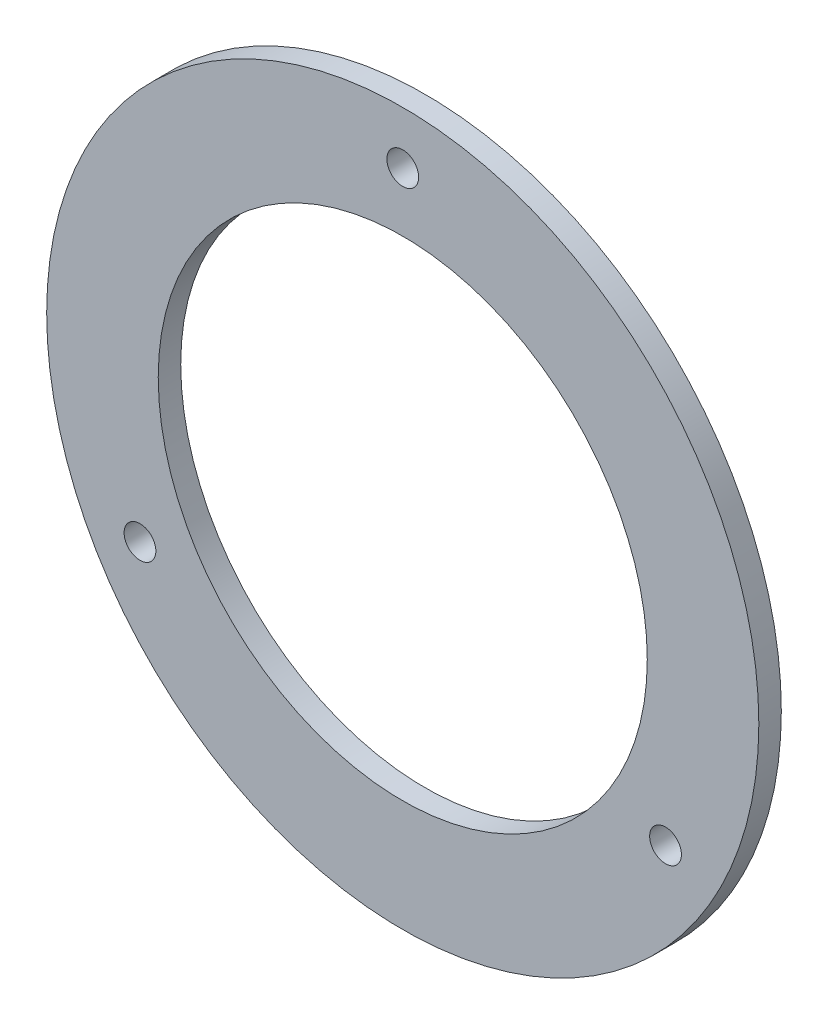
ISO-10303-21;
HEADER;
FILE_DESCRIPTION(('STEP AP214'),'2;1');
FILE_NAME('part.step','',(''),(''),'','','');
FILE_SCHEMA(('AUTOMOTIVE_DESIGN { 1 0 10303 214 1 1 1 1 }'));
ENDSEC;
DATA;
#1=APPLICATION_CONTEXT('core data for automotive mechanical design processes');
#2=APPLICATION_PROTOCOL_DEFINITION('international standard','automotive_design',2000,#1);
#3=PRODUCT_CONTEXT('',#1,'mechanical');
#4=PRODUCT('Part','Part','',(#3));
#5=PRODUCT_RELATED_PRODUCT_CATEGORY('part','',(#4));
#6=PRODUCT_DEFINITION_FORMATION('','',#4);
#7=PRODUCT_DEFINITION_CONTEXT('part definition',#1,'design');
#8=PRODUCT_DEFINITION('design','',#6,#7);
#9=PRODUCT_DEFINITION_SHAPE('','',#8);
#10=(LENGTH_UNIT() NAMED_UNIT(*) SI_UNIT(.MILLI.,.METRE.));
#11=(NAMED_UNIT(*) PLANE_ANGLE_UNIT() SI_UNIT($,.RADIAN.));
#12=(NAMED_UNIT(*) SI_UNIT($,.STERADIAN.) SOLID_ANGLE_UNIT());
#13=UNCERTAINTY_MEASURE_WITH_UNIT(LENGTH_MEASURE(1.E-05),#10,'distance_accuracy_value','');
#14=(GEOMETRIC_REPRESENTATION_CONTEXT(3) GLOBAL_UNCERTAINTY_ASSIGNED_CONTEXT((#13)) GLOBAL_UNIT_ASSIGNED_CONTEXT((#10,
#11,#12)) REPRESENTATION_CONTEXT('',''));
#15=CARTESIAN_POINT('',(0.,0.,0.));
#16=DIRECTION('',(0.,0.,1.));
#17=DIRECTION('',(1.,0.,0.));
#18=AXIS2_PLACEMENT_3D('',#15,#16,#17);
#19=CARTESIAN_POINT('',(0.,0.,1.6002));
#20=DIRECTION('',(0.,0.,1.));
#21=DIRECTION('',(1.,0.,0.));
#22=AXIS2_PLACEMENT_3D('',#19,#20,#21);
#23=PLANE('',#22);
#24=CARTESIAN_POINT('',(0.,21.59,1.6002));
#25=DIRECTION('',(0.,0.,1.));
#26=DIRECTION('',(1.,0.,0.));
#27=AXIS2_PLACEMENT_3D('',#24,#25,#26);
#28=CIRCLE('',#27,1.13029999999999);
#29=CARTESIAN_POINT('',(1.13029999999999,21.59,1.6002));
#30=VERTEX_POINT('',#29);
#31=EDGE_CURVE('E66',#30,#30,#28,.T.);
#32=ORIENTED_EDGE('',*,*,#31,.F.);
#33=EDGE_LOOP('',(#32));
#34=FACE_BOUND('',#33,.T.);
#35=CARTESIAN_POINT('',(18.6974884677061,-10.7949999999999,1.6002));
#36=DIRECTION('',(0.,0.,1.));
#37=DIRECTION('',(1.,0.,0.));
#38=AXIS2_PLACEMENT_3D('',#35,#36,#37);
#39=CIRCLE('',#38,1.13029999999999);
#40=CARTESIAN_POINT('',(19.827788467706,-10.7949999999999,1.6002));
#41=VERTEX_POINT('',#40);
#42=EDGE_CURVE('E60',#41,#41,#39,.T.);
#43=ORIENTED_EDGE('',*,*,#42,.F.);
#44=EDGE_LOOP('',(#43));
#45=FACE_BOUND('',#44,.T.);
#46=CARTESIAN_POINT('',(-18.6974884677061,-10.795,1.6002));
#47=DIRECTION('',(0.,0.,1.));
#48=DIRECTION('',(1.,0.,0.));
#49=AXIS2_PLACEMENT_3D('',#46,#47,#48);
#50=CIRCLE('',#49,1.13029999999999);
#51=CARTESIAN_POINT('',(-17.5671884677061,-10.795,1.6002));
#52=VERTEX_POINT('',#51);
#53=EDGE_CURVE('E54',#52,#52,#50,.T.);
#54=ORIENTED_EDGE('',*,*,#53,.F.);
#55=EDGE_LOOP('',(#54));
#56=FACE_BOUND('',#55,.T.);
#57=CARTESIAN_POINT('',(0.,0.,1.6002));
#58=DIRECTION('',(0.,0.,1.));
#59=DIRECTION('',(1.,0.,0.));
#60=AXIS2_PLACEMENT_3D('',#57,#58,#59);
#61=CIRCLE('',#60,25.3365);
#62=CARTESIAN_POINT('',(25.3365,0.,1.6002));
#63=VERTEX_POINT('',#62);
#64=EDGE_CURVE('E10',#63,#63,#61,.T.);
#65=ORIENTED_EDGE('',*,*,#64,.T.);
#66=EDGE_LOOP('',(#65));
#67=FACE_BOUND('',#66,.T.);
#68=CARTESIAN_POINT('',(0.,0.,1.6002));
#69=DIRECTION('',(0.,0.,1.));
#70=DIRECTION('',(1.,0.,0.));
#71=AXIS2_PLACEMENT_3D('',#68,#69,#70);
#72=CIRCLE('',#71,17.399);
#73=CARTESIAN_POINT('',(17.399,0.,1.6002));
#74=VERTEX_POINT('',#73);
#75=EDGE_CURVE('E44',#74,#74,#72,.T.);
#76=ORIENTED_EDGE('',*,*,#75,.F.);
#77=EDGE_LOOP('',(#76));
#78=FACE_BOUND('',#77,.T.);
#79=ADVANCED_FACE('F33',(#34,#45,#56,#67,#78),#23,.T.);
#80=CARTESIAN_POINT('',(0.,0.,0.));
#81=DIRECTION('',(0.,0.,1.));
#82=DIRECTION('',(1.,0.,0.));
#83=AXIS2_PLACEMENT_3D('',#80,#81,#82);
#84=PLANE('',#83);
#85=CARTESIAN_POINT('',(0.,21.59,0.));
#86=DIRECTION('',(0.,0.,1.));
#87=DIRECTION('',(1.,0.,0.));
#88=AXIS2_PLACEMENT_3D('',#85,#86,#87);
#89=CIRCLE('',#88,1.13029999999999);
#90=CARTESIAN_POINT('',(1.13029999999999,21.59,0.));
#91=VERTEX_POINT('',#90);
#92=EDGE_CURVE('E63',#91,#91,#89,.T.);
#93=ORIENTED_EDGE('',*,*,#92,.T.);
#94=EDGE_LOOP('',(#93));
#95=FACE_BOUND('',#94,.T.);
#96=CARTESIAN_POINT('',(18.6974884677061,-10.7949999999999,0.));
#97=DIRECTION('',(0.,0.,1.));
#98=DIRECTION('',(1.,0.,0.));
#99=AXIS2_PLACEMENT_3D('',#96,#97,#98);
#100=CIRCLE('',#99,1.13029999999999);
#101=CARTESIAN_POINT('',(19.827788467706,-10.7949999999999,0.));
#102=VERTEX_POINT('',#101);
#103=EDGE_CURVE('E57',#102,#102,#100,.T.);
#104=ORIENTED_EDGE('',*,*,#103,.T.);
#105=EDGE_LOOP('',(#104));
#106=FACE_BOUND('',#105,.T.);
#107=CARTESIAN_POINT('',(-18.6974884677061,-10.795,0.));
#108=DIRECTION('',(0.,0.,1.));
#109=DIRECTION('',(1.,0.,0.));
#110=AXIS2_PLACEMENT_3D('',#107,#108,#109);
#111=CIRCLE('',#110,1.13029999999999);
#112=CARTESIAN_POINT('',(-17.5671884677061,-10.795,0.));
#113=VERTEX_POINT('',#112);
#114=EDGE_CURVE('E49',#113,#113,#111,.T.);
#115=ORIENTED_EDGE('',*,*,#114,.T.);
#116=EDGE_LOOP('',(#115));
#117=FACE_BOUND('',#116,.T.);
#118=CARTESIAN_POINT('',(0.,0.,0.));
#119=DIRECTION('',(0.,0.,1.));
#120=DIRECTION('',(1.,0.,0.));
#121=AXIS2_PLACEMENT_3D('',#118,#119,#120);
#122=CIRCLE('',#121,25.3365);
#123=CARTESIAN_POINT('',(25.3365,0.,0.));
#124=VERTEX_POINT('',#123);
#125=EDGE_CURVE('E37',#124,#124,#122,.T.);
#126=ORIENTED_EDGE('',*,*,#125,.F.);
#127=EDGE_LOOP('',(#126));
#128=FACE_BOUND('',#127,.T.);
#129=CARTESIAN_POINT('',(0.,0.,0.));
#130=DIRECTION('',(0.,0.,1.));
#131=DIRECTION('',(1.,0.,0.));
#132=AXIS2_PLACEMENT_3D('',#129,#130,#131);
#133=CIRCLE('',#132,17.399);
#134=CARTESIAN_POINT('',(17.399,0.,0.));
#135=VERTEX_POINT('',#134);
#136=EDGE_CURVE('E46',#135,#135,#133,.T.);
#137=ORIENTED_EDGE('',*,*,#136,.T.);
#138=EDGE_LOOP('',(#137));
#139=FACE_BOUND('',#138,.T.);
#140=ADVANCED_FACE('F74',(#95,#106,#117,#128,#139),#84,.F.);
#141=CARTESIAN_POINT('',(0.,0.,1.6002));
#142=DIRECTION('',(0.,0.,-1.));
#143=DIRECTION('',(-1.,0.,0.));
#144=AXIS2_PLACEMENT_3D('',#141,#142,#143);
#145=CYLINDRICAL_SURFACE('',#144,25.3365);
#146=ORIENTED_EDGE('',*,*,#64,.F.);
#147=EDGE_LOOP('',(#146));
#148=FACE_BOUND('',#147,.T.);
#149=ORIENTED_EDGE('',*,*,#125,.T.);
#150=EDGE_LOOP('',(#149));
#151=FACE_BOUND('',#150,.T.);
#152=ADVANCED_FACE('F35',(#148,#151),#145,.T.);
#153=CARTESIAN_POINT('',(0.,0.,1.6002));
#154=DIRECTION('',(0.,0.,-1.));
#155=DIRECTION('',(-1.,0.,0.));
#156=AXIS2_PLACEMENT_3D('',#153,#154,#155);
#157=CYLINDRICAL_SURFACE('',#156,17.399);
#158=ORIENTED_EDGE('',*,*,#75,.T.);
#159=EDGE_LOOP('',(#158));
#160=FACE_BOUND('',#159,.T.);
#161=ORIENTED_EDGE('',*,*,#136,.F.);
#162=EDGE_LOOP('',(#161));
#163=FACE_BOUND('',#162,.T.);
#164=ADVANCED_FACE('F82',(#160,#163),#157,.F.);
#165=CARTESIAN_POINT('',(-18.6974884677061,-10.795,1.6002));
#166=DIRECTION('',(0.,0.,1.));
#167=DIRECTION('',(1.,0.,0.));
#168=AXIS2_PLACEMENT_3D('',#165,#166,#167);
#169=CYLINDRICAL_SURFACE('',#168,1.13029999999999);
#170=ORIENTED_EDGE('',*,*,#114,.F.);
#171=EDGE_LOOP('',(#170));
#172=FACE_BOUND('',#171,.T.);
#173=ORIENTED_EDGE('',*,*,#53,.T.);
#174=EDGE_LOOP('',(#173));
#175=FACE_BOUND('',#174,.T.);
#176=ADVANCED_FACE('F85',(#172,#175),#169,.F.);
#177=CARTESIAN_POINT('',(18.6974884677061,-10.7949999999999,1.6002));
#178=DIRECTION('',(0.,0.,1.));
#179=DIRECTION('',(1.,0.,0.));
#180=AXIS2_PLACEMENT_3D('',#177,#178,#179);
#181=CYLINDRICAL_SURFACE('',#180,1.13029999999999);
#182=ORIENTED_EDGE('',*,*,#103,.F.);
#183=EDGE_LOOP('',(#182));
#184=FACE_BOUND('',#183,.T.);
#185=ORIENTED_EDGE('',*,*,#42,.T.);
#186=EDGE_LOOP('',(#185));
#187=FACE_BOUND('',#186,.T.);
#188=ADVANCED_FACE('F99',(#184,#187),#181,.F.);
#189=CARTESIAN_POINT('',(0.,21.59,1.6002));
#190=DIRECTION('',(0.,0.,1.));
#191=DIRECTION('',(1.,0.,0.));
#192=AXIS2_PLACEMENT_3D('',#189,#190,#191);
#193=CYLINDRICAL_SURFACE('',#192,1.13029999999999);
#194=ORIENTED_EDGE('',*,*,#92,.F.);
#195=EDGE_LOOP('',(#194));
#196=FACE_BOUND('',#195,.T.);
#197=ORIENTED_EDGE('',*,*,#31,.T.);
#198=EDGE_LOOP('',(#197));
#199=FACE_BOUND('',#198,.T.);
#200=ADVANCED_FACE('F70',(#196,#199),#193,.F.);
#201=CLOSED_SHELL('',(#79,#140,#152,#164,#176,#188,#200));
#202=MANIFOLD_SOLID_BREP('B2',#201);
#203=ADVANCED_BREP_SHAPE_REPRESENTATION('',(#18,#202),#14);
#204=SHAPE_DEFINITION_REPRESENTATION(#9,#203);
ENDSEC;
END-ISO-10303-21;
